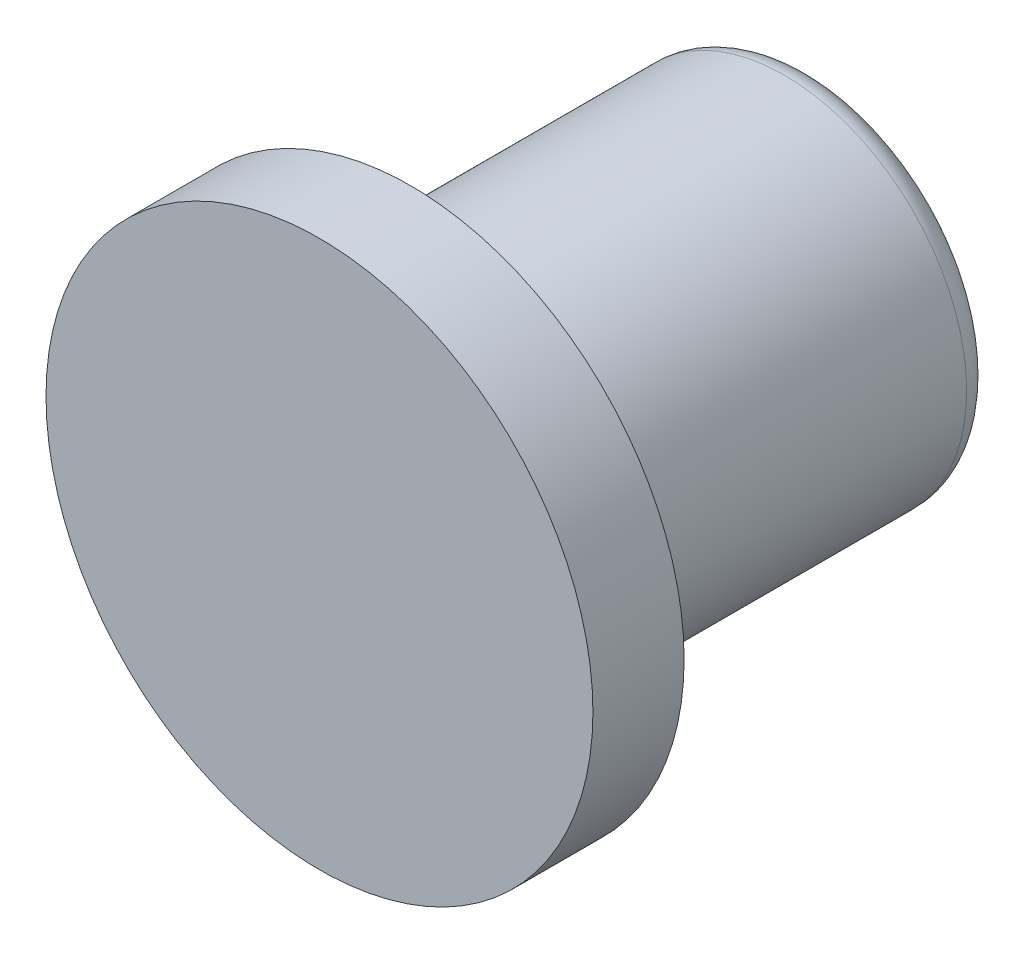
ISO-10303-21;
HEADER;
FILE_DESCRIPTION(('STEP AP214'),'2;1');
FILE_NAME('part.step','',(''),(''),'','','');
FILE_SCHEMA(('AUTOMOTIVE_DESIGN { 1 0 10303 214 1 1 1 1 }'));
ENDSEC;
DATA;
#1=APPLICATION_CONTEXT('core data for automotive mechanical design processes');
#2=APPLICATION_PROTOCOL_DEFINITION('international standard','automotive_design',2000,#1);
#3=PRODUCT_CONTEXT('',#1,'mechanical');
#4=PRODUCT('Part','Part','',(#3));
#5=PRODUCT_RELATED_PRODUCT_CATEGORY('part','',(#4));
#6=PRODUCT_DEFINITION_FORMATION('','',#4);
#7=PRODUCT_DEFINITION_CONTEXT('part definition',#1,'design');
#8=PRODUCT_DEFINITION('design','',#6,#7);
#9=PRODUCT_DEFINITION_SHAPE('','',#8);
#10=(LENGTH_UNIT() NAMED_UNIT(*) SI_UNIT(.MILLI.,.METRE.));
#11=(NAMED_UNIT(*) PLANE_ANGLE_UNIT() SI_UNIT($,.RADIAN.));
#12=(NAMED_UNIT(*) SI_UNIT($,.STERADIAN.) SOLID_ANGLE_UNIT());
#13=UNCERTAINTY_MEASURE_WITH_UNIT(LENGTH_MEASURE(1.E-05),#10,'distance_accuracy_value','');
#14=(GEOMETRIC_REPRESENTATION_CONTEXT(3) GLOBAL_UNCERTAINTY_ASSIGNED_CONTEXT((#13)) GLOBAL_UNIT_ASSIGNED_CONTEXT((#10,
#11,#12)) REPRESENTATION_CONTEXT('',''));
#15=CARTESIAN_POINT('',(0.,0.,0.));
#16=DIRECTION('',(0.,0.,1.));
#17=DIRECTION('',(1.,0.,0.));
#18=AXIS2_PLACEMENT_3D('',#15,#16,#17);
#19=CARTESIAN_POINT('',(0.,0.,0.));
#20=DIRECTION('',(0.,0.,-1.));
#21=DIRECTION('',(-1.,0.,0.));
#22=AXIS2_PLACEMENT_3D('',#19,#20,#21);
#23=PLANE('',#22);
#24=CARTESIAN_POINT('',(0.,0.,0.));
#25=DIRECTION('',(0.,0.,1.));
#26=DIRECTION('',(1.,0.,0.));
#27=AXIS2_PLACEMENT_3D('',#24,#25,#26);
#28=CIRCLE('',#27,15.);
#29=CARTESIAN_POINT('',(15.,0.,0.));
#30=VERTEX_POINT('',#29);
#31=EDGE_CURVE('E12',#30,#30,#28,.T.);
#32=ORIENTED_EDGE('',*,*,#31,.T.);
#33=EDGE_LOOP('',(#32));
#34=FACE_BOUND('',#33,.T.);
#35=ADVANCED_FACE('F33',(#34),#23,.F.);
#36=CARTESIAN_POINT('',(0.,0.,0.));
#37=DIRECTION('',(0.,0.,1.));
#38=DIRECTION('',(1.,0.,0.));
#39=AXIS2_PLACEMENT_3D('',#36,#37,#38);
#40=CYLINDRICAL_SURFACE('',#39,15.);
#41=ORIENTED_EDGE('',*,*,#31,.F.);
#42=EDGE_LOOP('',(#41));
#43=FACE_BOUND('',#42,.T.);
#44=CARTESIAN_POINT('',(0.,0.,-5.));
#45=DIRECTION('',(0.,0.,1.));
#46=DIRECTION('',(1.,0.,0.));
#47=AXIS2_PLACEMENT_3D('',#44,#45,#46);
#48=CIRCLE('',#47,15.);
#49=CARTESIAN_POINT('',(15.,0.,-5.));
#50=VERTEX_POINT('',#49);
#51=EDGE_CURVE('E39',#50,#50,#48,.T.);
#52=ORIENTED_EDGE('',*,*,#51,.T.);
#53=EDGE_LOOP('',(#52));
#54=FACE_BOUND('',#53,.T.);
#55=ADVANCED_FACE('F70',(#43,#54),#40,.T.);
#56=CARTESIAN_POINT('',(0.,15.,-5.));
#57=DIRECTION('',(0.,0.,1.));
#58=DIRECTION('',(1.,0.,0.));
#59=AXIS2_PLACEMENT_3D('',#56,#57,#58);
#60=PLANE('',#59);
#61=ORIENTED_EDGE('',*,*,#51,.F.);
#62=EDGE_LOOP('',(#61));
#63=FACE_BOUND('',#62,.T.);
#64=CARTESIAN_POINT('',(0.,0.,-5.));
#65=DIRECTION('',(0.,0.,1.));
#66=DIRECTION('',(1.,0.,0.));
#67=AXIS2_PLACEMENT_3D('',#64,#65,#66);
#68=CIRCLE('',#67,10.);
#69=CARTESIAN_POINT('',(10.,0.,-5.));
#70=VERTEX_POINT('',#69);
#71=EDGE_CURVE('E65',#70,#70,#68,.T.);
#72=ORIENTED_EDGE('',*,*,#71,.T.);
#73=EDGE_LOOP('',(#72));
#74=FACE_BOUND('',#73,.T.);
#75=ADVANCED_FACE('F72',(#63,#74),#60,.F.);
#76=CARTESIAN_POINT('',(0.,0.,0.));
#77=DIRECTION('',(0.,0.,1.));
#78=DIRECTION('',(1.,0.,0.));
#79=AXIS2_PLACEMENT_3D('',#76,#77,#78);
#80=CYLINDRICAL_SURFACE('',#79,10.);
#81=ORIENTED_EDGE('',*,*,#71,.F.);
#82=EDGE_LOOP('',(#81));
#83=FACE_BOUND('',#82,.T.);
#84=CARTESIAN_POINT('',(0.,0.,-25.5));
#85=DIRECTION('',(0.,0.,1.));
#86=DIRECTION('',(1.,0.,0.));
#87=AXIS2_PLACEMENT_3D('',#84,#85,#86);
#88=CIRCLE('',#87,10.);
#89=CARTESIAN_POINT('',(10.,0.,-25.5));
#90=VERTEX_POINT('',#89);
#91=EDGE_CURVE('E62',#90,#90,#88,.T.);
#92=ORIENTED_EDGE('',*,*,#91,.T.);
#93=EDGE_LOOP('',(#92));
#94=FACE_BOUND('',#93,.T.);
#95=ADVANCED_FACE('F75',(#83,#94),#80,.T.);
#96=CARTESIAN_POINT('',(0.,0.,-25.5));
#97=DIRECTION('',(0.,0.,1.));
#98=DIRECTION('',(1.,0.,0.));
#99=AXIS2_PLACEMENT_3D('',#96,#97,#98);
#100=TOROIDAL_SURFACE('',#99,8.5,1.5);
#101=ORIENTED_EDGE('',*,*,#91,.F.);
#102=EDGE_LOOP('',(#101));
#103=FACE_BOUND('',#102,.T.);
#104=CARTESIAN_POINT('',(0.,0.,-27.));
#105=DIRECTION('',(0.,0.,1.));
#106=DIRECTION('',(1.,0.,0.));
#107=AXIS2_PLACEMENT_3D('',#104,#105,#106);
#108=CIRCLE('',#107,8.5);
#109=CARTESIAN_POINT('',(8.5,0.,-27.));
#110=VERTEX_POINT('',#109);
#111=EDGE_CURVE('E59',#110,#110,#108,.T.);
#112=ORIENTED_EDGE('',*,*,#111,.T.);
#113=EDGE_LOOP('',(#112));
#114=FACE_BOUND('',#113,.T.);
#115=ADVANCED_FACE('F81',(#103,#114),#100,.T.);
#116=CARTESIAN_POINT('',(0.,8.5,-27.));
#117=DIRECTION('',(0.,0.,1.));
#118=DIRECTION('',(1.,0.,0.));
#119=AXIS2_PLACEMENT_3D('',#116,#117,#118);
#120=PLANE('',#119);
#121=CARTESIAN_POINT('',(0.,0.,-27.));
#122=DIRECTION('',(0.,0.,-1.));
#123=DIRECTION('',(0.,1.,0.));
#124=AXIS2_PLACEMENT_3D('',#121,#122,#123);
#125=CIRCLE('',#124,3.);
#126=CARTESIAN_POINT('',(0.,3.,-27.));
#127=VERTEX_POINT('',#126);
#128=EDGE_CURVE('E54',#127,#127,#125,.T.);
#129=ORIENTED_EDGE('',*,*,#128,.F.);
#130=EDGE_LOOP('',(#129));
#131=FACE_BOUND('',#130,.T.);
#132=ORIENTED_EDGE('',*,*,#111,.F.);
#133=EDGE_LOOP('',(#132));
#134=FACE_BOUND('',#133,.T.);
#135=ADVANCED_FACE('F87',(#131,#134),#120,.F.);
#136=CARTESIAN_POINT('',(0.,0.,-27.));
#137=DIRECTION('',(0.,0.,-1.));
#138=DIRECTION('',(0.,1.,0.));
#139=AXIS2_PLACEMENT_3D('',#136,#137,#138);
#140=CONICAL_SURFACE('',#139,3.,0.785398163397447);
#141=CARTESIAN_POINT('',(0.,0.,-26.5));
#142=DIRECTION('',(0.,0.,-1.));
#143=DIRECTION('',(0.,1.,0.));
#144=AXIS2_PLACEMENT_3D('',#141,#142,#143);
#145=CIRCLE('',#144,2.5);
#146=CARTESIAN_POINT('',(0.,2.5,-26.5));
#147=VERTEX_POINT('',#146);
#148=EDGE_CURVE('E51',#147,#147,#145,.T.);
#149=ORIENTED_EDGE('',*,*,#148,.F.);
#150=EDGE_LOOP('',(#149));
#151=FACE_BOUND('',#150,.T.);
#152=ORIENTED_EDGE('',*,*,#128,.T.);
#153=EDGE_LOOP('',(#152));
#154=FACE_BOUND('',#153,.T.);
#155=ADVANCED_FACE('F92',(#151,#154),#140,.F.);
#156=CARTESIAN_POINT('',(0.,0.,-27.));
#157=DIRECTION('',(0.,0.,-1.));
#158=DIRECTION('',(0.,1.,0.));
#159=AXIS2_PLACEMENT_3D('',#156,#157,#158);
#160=CYLINDRICAL_SURFACE('',#159,2.5);
#161=CARTESIAN_POINT('',(0.,0.,-21.));
#162=DIRECTION('',(0.,0.,-1.));
#163=DIRECTION('',(0.,1.,0.));
#164=AXIS2_PLACEMENT_3D('',#161,#162,#163);
#165=CIRCLE('',#164,2.5);
#166=CARTESIAN_POINT('',(0.,2.5,-21.));
#167=VERTEX_POINT('',#166);
#168=EDGE_CURVE('E49',#167,#167,#165,.T.);
#169=ORIENTED_EDGE('',*,*,#168,.F.);
#170=EDGE_LOOP('',(#169));
#171=FACE_BOUND('',#170,.T.);
#172=ORIENTED_EDGE('',*,*,#148,.T.);
#173=EDGE_LOOP('',(#172));
#174=FACE_BOUND('',#173,.T.);
#175=ADVANCED_FACE('F45',(#171,#174),#160,.F.);
#176=CARTESIAN_POINT('',(0.,0.,-21.));
#177=DIRECTION('',(0.,0.,-1.));
#178=DIRECTION('',(0.,1.,0.));
#179=AXIS2_PLACEMENT_3D('',#176,#177,#178);
#180=CONICAL_SURFACE('',#179,2.5,1.18682389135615);
#181=CARTESIAN_POINT('',(0.,0.,-19.9899344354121));
#182=VERTEX_POINT('',#181);
#183=VERTEX_LOOP('',#182);
#184=FACE_BOUND('',#183,.T.);
#185=ORIENTED_EDGE('',*,*,#168,.T.);
#186=EDGE_LOOP('',(#185));
#187=FACE_BOUND('',#186,.T.);
#188=ADVANCED_FACE('F42',(#184,#187),#180,.F.);
#189=CLOSED_SHELL('',(#35,#55,#75,#95,#115,#135,#155,#175,#188));
#190=MANIFOLD_SOLID_BREP('B2',#189);
#191=ADVANCED_BREP_SHAPE_REPRESENTATION('',(#18,#190),#14);
#192=SHAPE_DEFINITION_REPRESENTATION(#9,#191);
ENDSEC;
END-ISO-10303-21;
